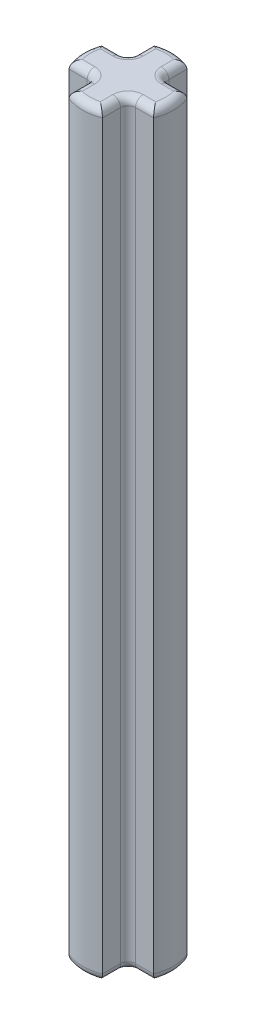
from build123d import *

# Parameters (mm, degrees)
BOSS_EXTRUDE1_DEPTH = 40
FILLET7_R           = 0.4


with BuildPart() as part:
    # Sketch1 → Boss-Extrude1 (new body)
    with BuildSketch(Plane(origin=(0, 0, 0), x_dir=(1, 0, 0), z_dir=(0, 1, 0))):
        with BuildLine():
            Line((-2.232845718, 0.88), (-0.88, 0.88))
            Line((-0.88, 0.88), (-0.88, 2.232845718))
            ThreePointArc((-0.88, 2.232845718), (0, 2.4), (0.88, 2.232845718))
            Line((0.88, 2.232845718), (0.88, 0.88))
            Line((0.88, 0.88), (2.232845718, 0.88))
            ThreePointArc((2.232845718, 0.88), (2.4, 0), (2.232845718, -0.88))
            Line((2.232845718, -0.88), (0.88, -0.88))
            Line((0.88, -0.88), (0.88, -2.232845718))
            ThreePointArc((0.88, -2.232845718), (0, -2.4), (-0.88, -2.232845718))
            Line((-0.88, -2.232845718), (-0.88, -0.88))
            Line((-0.88, -0.88), (-2.232845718, -0.88))
            ThreePointArc((-2.232845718, -0.88), (-2.4, 0), (-2.232845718, 0.88))
        make_face()
    extrude(amount=BOSS_EXTRUDE1_DEPTH)

    # Fillet7
    fillet7_edges = [part.edges().sort_by_distance(p)[0] for p in [
        (-2.4, 40, 0),
        (0, 0, -2.4),
        (0.88, 0, -1.556422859),
        (1.556422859, 0, -0.88),
        (2.4, 0, 0),
        (1.556422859, 0, 0.88),
        (0.88, 0, 1.556422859),
        (-1.556422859, 40, 0.88),
        (0, 0, 2.4),
        (-0.88, 0, 1.556422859),
        (-1.556422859, 0, 0.88),
        (-2.4, 0, 0),
        (-1.556422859, 0, -0.88),
        (-0.88, 0, -1.556422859),
        (-0.88, 40, 1.556422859),
        (0, 40, 2.4),
        (0.88, 20, -0.88),
        (0.88, 20, 0.88),
        (-0.88, 20, 0.88),
        (-0.88, 20, -0.88),
        (0.88, 40, 1.556422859),
        (1.556422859, 40, 0.88),
        (2.4, 40, 0),
        (1.556422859, 40, -0.88),
        (0.88, 40, -1.556422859),
        (0, 40, -2.4),
        (-0.88, 40, -1.556422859),
        (-1.556422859, 40, -0.88),
    ]]
    fillet(fillet7_edges, radius=FILLET7_R)


solid = part.part
